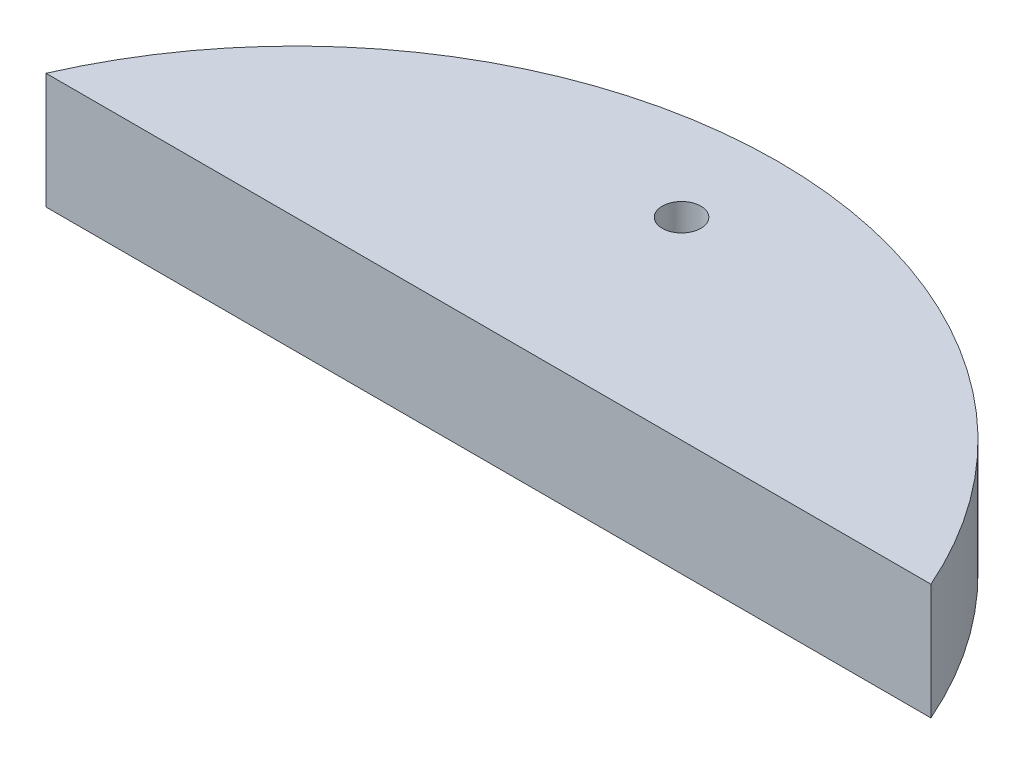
from build123d import *

# Parameters (mm, degrees)
SKETCH1_R           = 12.5
SKETCH1_R_2         = 1.75
SKETCH1_R_3         = 0.5
BOSS_EXTRUDE1_DEPTH = 3
SKETCH2_W           = 25
SKETCH2_H           = 24.044079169
CUT_EXTRUDE1_DEPTH  = 10


with BuildPart() as part:
    # Sketch1 → Boss-Extrude1 (new body)
    with BuildSketch(Plane(origin=(0, 0, 0), x_dir=(1, 0, 0), z_dir=(0, 1, 0))):
        with Locations(Location((0, 0, 0), (0, 0, 270))):
            Circle(SKETCH1_R)
        with Locations(Location((0, 0, 0), (0, 0, 270))):
            Circle(SKETCH1_R_2, mode=Mode.SUBTRACT)
        with Locations(Location((0, 10, 0), (0, 0, 270))):
            Circle(SKETCH1_R_3, mode=Mode.SUBTRACT)
    extrude(amount=BOSS_EXTRUDE1_DEPTH)

    # Sketch2 → Cut-Extrude1 (cut)
    with BuildSketch(Plane(origin=(0, 0, 0), x_dir=(1, 0, 0), z_dir=(0, 1, 0))):
        with Locations((0, -7.022039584)):
            Rectangle(SKETCH2_W, SKETCH2_H)
    extrude(amount=CUT_EXTRUDE1_DEPTH, mode=Mode.SUBTRACT)


solid = part.part
